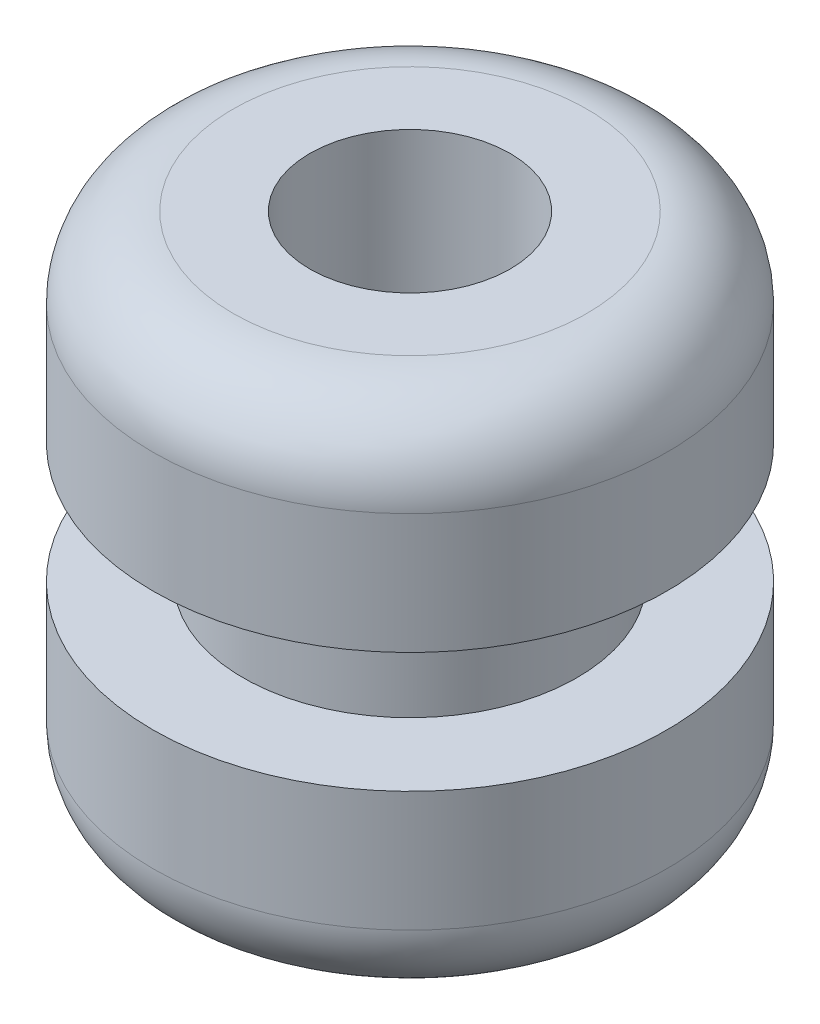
ISO-10303-21;
HEADER;
FILE_DESCRIPTION(('STEP AP214'),'2;1');
FILE_NAME('part.step','',(''),(''),'','','');
FILE_SCHEMA(('AUTOMOTIVE_DESIGN { 1 0 10303 214 1 1 1 1 }'));
ENDSEC;
DATA;
#1=APPLICATION_CONTEXT('core data for automotive mechanical design processes');
#2=APPLICATION_PROTOCOL_DEFINITION('international standard','automotive_design',2000,#1);
#3=PRODUCT_CONTEXT('',#1,'mechanical');
#4=PRODUCT('Part','Part','',(#3));
#5=PRODUCT_RELATED_PRODUCT_CATEGORY('part','',(#4));
#6=PRODUCT_DEFINITION_FORMATION('','',#4);
#7=PRODUCT_DEFINITION_CONTEXT('part definition',#1,'design');
#8=PRODUCT_DEFINITION('design','',#6,#7);
#9=PRODUCT_DEFINITION_SHAPE('','',#8);
#10=(LENGTH_UNIT() NAMED_UNIT(*) SI_UNIT(.MILLI.,.METRE.));
#11=(NAMED_UNIT(*) PLANE_ANGLE_UNIT() SI_UNIT($,.RADIAN.));
#12=(NAMED_UNIT(*) SI_UNIT($,.STERADIAN.) SOLID_ANGLE_UNIT());
#13=UNCERTAINTY_MEASURE_WITH_UNIT(LENGTH_MEASURE(1.E-05),#10,'distance_accuracy_value','');
#14=(GEOMETRIC_REPRESENTATION_CONTEXT(3) GLOBAL_UNCERTAINTY_ASSIGNED_CONTEXT((#13)) GLOBAL_UNIT_ASSIGNED_CONTEXT((#10,
#11,#12)) REPRESENTATION_CONTEXT('',''));
#15=CARTESIAN_POINT('',(0.,0.,0.));
#16=DIRECTION('',(0.,0.,1.));
#17=DIRECTION('',(1.,0.,0.));
#18=AXIS2_PLACEMENT_3D('',#15,#16,#17);
#19=CARTESIAN_POINT('',(0.,0.,0.));
#20=DIRECTION('',(0.,-1.,0.));
#21=DIRECTION('',(0.,0.,-1.));
#22=AXIS2_PLACEMENT_3D('',#19,#20,#21);
#23=CYLINDRICAL_SURFACE('',#22,3.175);
#24=CARTESIAN_POINT('',(0.,2.286,0.));
#25=DIRECTION('',(0.,-1.,0.));
#26=DIRECTION('',(0.,0.,-1.));
#27=AXIS2_PLACEMENT_3D('',#24,#25,#26);
#28=CIRCLE('',#27,3.175);
#29=CARTESIAN_POINT('',(0.,2.286,-3.175));
#30=VERTEX_POINT('',#29);
#31=EDGE_CURVE('E62',#30,#30,#28,.T.);
#32=ORIENTED_EDGE('',*,*,#31,.T.);
#33=EDGE_LOOP('',(#32));
#34=FACE_BOUND('',#33,.T.);
#35=CARTESIAN_POINT('',(0.,0.,0.));
#36=DIRECTION('',(0.,-1.,0.));
#37=DIRECTION('',(0.,0.,-1.));
#38=AXIS2_PLACEMENT_3D('',#35,#36,#37);
#39=CIRCLE('',#38,3.175);
#40=CARTESIAN_POINT('',(0.,0.,-3.175));
#41=VERTEX_POINT('',#40);
#42=EDGE_CURVE('E53',#41,#41,#39,.T.);
#43=ORIENTED_EDGE('',*,*,#42,.F.);
#44=EDGE_LOOP('',(#43));
#45=FACE_BOUND('',#44,.T.);
#46=ADVANCED_FACE('F33',(#34,#45),#23,.T.);
#47=CARTESIAN_POINT('',(0.,0.,-3.175));
#48=DIRECTION('',(0.,1.,0.));
#49=DIRECTION('',(0.,0.,1.));
#50=AXIS2_PLACEMENT_3D('',#47,#48,#49);
#51=PLANE('',#50);
#52=ORIENTED_EDGE('',*,*,#42,.T.);
#53=EDGE_LOOP('',(#52));
#54=FACE_BOUND('',#53,.T.);
#55=CARTESIAN_POINT('',(0.,0.,0.));
#56=DIRECTION('',(0.,-1.,0.));
#57=DIRECTION('',(0.,0.,-1.));
#58=AXIS2_PLACEMENT_3D('',#55,#56,#57);
#59=CIRCLE('',#58,4.8895);
#60=CARTESIAN_POINT('',(0.,0.,-4.8895));
#61=VERTEX_POINT('',#60);
#62=EDGE_CURVE('E56',#61,#61,#59,.T.);
#63=ORIENTED_EDGE('',*,*,#62,.F.);
#64=EDGE_LOOP('',(#63));
#65=FACE_BOUND('',#64,.T.);
#66=ADVANCED_FACE('F94',(#54,#65),#51,.T.);
#67=CARTESIAN_POINT('',(0.,0.,0.));
#68=DIRECTION('',(0.,-1.,0.));
#69=DIRECTION('',(0.,0.,-1.));
#70=AXIS2_PLACEMENT_3D('',#67,#68,#69);
#71=CYLINDRICAL_SURFACE('',#70,4.8895);
#72=CARTESIAN_POINT('',(0.,-2.286,0.));
#73=DIRECTION('',(0.,-1.,0.));
#74=DIRECTION('',(0.,0.,-1.));
#75=AXIS2_PLACEMENT_3D('',#72,#73,#74);
#76=CIRCLE('',#75,4.8895);
#77=CARTESIAN_POINT('',(0.,-2.286,-4.8895));
#78=VERTEX_POINT('',#77);
#79=EDGE_CURVE('E44',#78,#78,#76,.F.);
#80=ORIENTED_EDGE('',*,*,#79,.T.);
#81=EDGE_LOOP('',(#80));
#82=FACE_BOUND('',#81,.T.);
#83=ORIENTED_EDGE('',*,*,#62,.T.);
#84=EDGE_LOOP('',(#83));
#85=FACE_BOUND('',#84,.T.);
#86=ADVANCED_FACE('F91',(#82,#85),#71,.T.);
#87=CARTESIAN_POINT('',(0.,-3.81,-4.8895));
#88=DIRECTION('',(0.,-1.,0.));
#89=DIRECTION('',(0.,0.,-1.));
#90=AXIS2_PLACEMENT_3D('',#87,#88,#89);
#91=PLANE('',#90);
#92=CARTESIAN_POINT('',(0.,-3.81,0.));
#93=DIRECTION('',(0.,1.,0.));
#94=DIRECTION('',(0.,0.,1.));
#95=AXIS2_PLACEMENT_3D('',#92,#93,#94);
#96=CIRCLE('',#95,1.905);
#97=CARTESIAN_POINT('',(0.,-3.81,1.905));
#98=VERTEX_POINT('',#97);
#99=EDGE_CURVE('E65',#98,#98,#96,.T.);
#100=ORIENTED_EDGE('',*,*,#99,.T.);
#101=EDGE_LOOP('',(#100));
#102=FACE_BOUND('',#101,.T.);
#103=CARTESIAN_POINT('',(0.,-3.81,0.));
#104=DIRECTION('',(0.,-1.,0.));
#105=DIRECTION('',(0.,0.,-1.));
#106=AXIS2_PLACEMENT_3D('',#103,#104,#105);
#107=CIRCLE('',#106,3.3655);
#108=CARTESIAN_POINT('',(0.,-3.81,-3.3655));
#109=VERTEX_POINT('',#108);
#110=EDGE_CURVE('E48',#109,#109,#107,.T.);
#111=ORIENTED_EDGE('',*,*,#110,.T.);
#112=EDGE_LOOP('',(#111));
#113=FACE_BOUND('',#112,.T.);
#114=ADVANCED_FACE('F72',(#102,#113),#91,.T.);
#115=CARTESIAN_POINT('',(0.,6.096,-4.8895));
#116=DIRECTION('',(0.,1.,0.));
#117=DIRECTION('',(0.,0.,1.));
#118=AXIS2_PLACEMENT_3D('',#115,#116,#117);
#119=PLANE('',#118);
#120=CARTESIAN_POINT('',(0.,6.096,0.));
#121=DIRECTION('',(0.,1.,0.));
#122=DIRECTION('',(0.,0.,1.));
#123=AXIS2_PLACEMENT_3D('',#120,#121,#122);
#124=CIRCLE('',#123,1.905);
#125=CARTESIAN_POINT('',(0.,6.096,1.905));
#126=VERTEX_POINT('',#125);
#127=EDGE_CURVE('E66',#126,#126,#124,.T.);
#128=ORIENTED_EDGE('',*,*,#127,.F.);
#129=EDGE_LOOP('',(#128));
#130=FACE_BOUND('',#129,.T.);
#131=CARTESIAN_POINT('',(0.,6.096,0.));
#132=DIRECTION('',(0.,1.,0.));
#133=DIRECTION('',(0.,0.,1.));
#134=AXIS2_PLACEMENT_3D('',#131,#132,#133);
#135=CIRCLE('',#134,3.3655);
#136=CARTESIAN_POINT('',(0.,6.096,3.3655));
#137=VERTEX_POINT('',#136);
#138=EDGE_CURVE('E10',#137,#137,#135,.T.);
#139=ORIENTED_EDGE('',*,*,#138,.T.);
#140=EDGE_LOOP('',(#139));
#141=FACE_BOUND('',#140,.T.);
#142=ADVANCED_FACE('F81',(#130,#141),#119,.T.);
#143=CARTESIAN_POINT('',(0.,0.,0.));
#144=DIRECTION('',(0.,-1.,0.));
#145=DIRECTION('',(0.,0.,-1.));
#146=AXIS2_PLACEMENT_3D('',#143,#144,#145);
#147=CYLINDRICAL_SURFACE('',#146,4.8895);
#148=CARTESIAN_POINT('',(0.,4.572,0.));
#149=DIRECTION('',(0.,1.,0.));
#150=DIRECTION('',(0.,0.,1.));
#151=AXIS2_PLACEMENT_3D('',#148,#149,#150);
#152=CIRCLE('',#151,4.8895);
#153=CARTESIAN_POINT('',(0.,4.572,4.8895));
#154=VERTEX_POINT('',#153);
#155=EDGE_CURVE('E40',#154,#154,#152,.F.);
#156=ORIENTED_EDGE('',*,*,#155,.T.);
#157=EDGE_LOOP('',(#156));
#158=FACE_BOUND('',#157,.T.);
#159=CARTESIAN_POINT('',(0.,2.286,0.));
#160=DIRECTION('',(0.,-1.,0.));
#161=DIRECTION('',(0.,0.,-1.));
#162=AXIS2_PLACEMENT_3D('',#159,#160,#161);
#163=CIRCLE('',#162,4.8895);
#164=CARTESIAN_POINT('',(0.,2.286,-4.8895));
#165=VERTEX_POINT('',#164);
#166=EDGE_CURVE('E59',#165,#165,#163,.T.);
#167=ORIENTED_EDGE('',*,*,#166,.F.);
#168=EDGE_LOOP('',(#167));
#169=FACE_BOUND('',#168,.T.);
#170=ADVANCED_FACE('F83',(#158,#169),#147,.T.);
#171=CARTESIAN_POINT('',(0.,2.286,-3.175));
#172=DIRECTION('',(0.,-1.,0.));
#173=DIRECTION('',(0.,0.,-1.));
#174=AXIS2_PLACEMENT_3D('',#171,#172,#173);
#175=PLANE('',#174);
#176=ORIENTED_EDGE('',*,*,#166,.T.);
#177=EDGE_LOOP('',(#176));
#178=FACE_BOUND('',#177,.T.);
#179=ORIENTED_EDGE('',*,*,#31,.F.);
#180=EDGE_LOOP('',(#179));
#181=FACE_BOUND('',#180,.T.);
#182=ADVANCED_FACE('F89',(#178,#181),#175,.T.);
#183=CARTESIAN_POINT('',(0.,-2.286,0.));
#184=DIRECTION('',(0.,-1.,0.));
#185=DIRECTION('',(0.,0.,-1.));
#186=AXIS2_PLACEMENT_3D('',#183,#184,#185);
#187=TOROIDAL_SURFACE('',#186,3.3655,1.524);
#188=ORIENTED_EDGE('',*,*,#79,.F.);
#189=EDGE_LOOP('',(#188));
#190=FACE_BOUND('',#189,.T.);
#191=ORIENTED_EDGE('',*,*,#110,.F.);
#192=EDGE_LOOP('',(#191));
#193=FACE_BOUND('',#192,.T.);
#194=ADVANCED_FACE('F104',(#190,#193),#187,.T.);
#195=CARTESIAN_POINT('',(0.,4.572,0.));
#196=DIRECTION('',(0.,1.,0.));
#197=DIRECTION('',(0.,0.,1.));
#198=AXIS2_PLACEMENT_3D('',#195,#196,#197);
#199=TOROIDAL_SURFACE('',#198,3.3655,1.524);
#200=ORIENTED_EDGE('',*,*,#138,.F.);
#201=EDGE_LOOP('',(#200));
#202=FACE_BOUND('',#201,.T.);
#203=ORIENTED_EDGE('',*,*,#155,.F.);
#204=EDGE_LOOP('',(#203));
#205=FACE_BOUND('',#204,.T.);
#206=ADVANCED_FACE('F35',(#202,#205),#199,.T.);
#207=CARTESIAN_POINT('',(0.,-3.81,0.));
#208=DIRECTION('',(0.,1.,0.));
#209=DIRECTION('',(0.,0.,1.));
#210=AXIS2_PLACEMENT_3D('',#207,#208,#209);
#211=CYLINDRICAL_SURFACE('',#210,1.905);
#212=ORIENTED_EDGE('',*,*,#99,.F.);
#213=EDGE_LOOP('',(#212));
#214=FACE_BOUND('',#213,.T.);
#215=ORIENTED_EDGE('',*,*,#127,.T.);
#216=EDGE_LOOP('',(#215));
#217=FACE_BOUND('',#216,.T.);
#218=ADVANCED_FACE('F75',(#214,#217),#211,.F.);
#219=CLOSED_SHELL('',(#46,#66,#86,#114,#142,#170,#182,#194,#206,#218));
#220=MANIFOLD_SOLID_BREP('B2',#219);
#221=ADVANCED_BREP_SHAPE_REPRESENTATION('',(#18,#220),#14);
#222=SHAPE_DEFINITION_REPRESENTATION(#9,#221);
ENDSEC;
END-ISO-10303-21;
